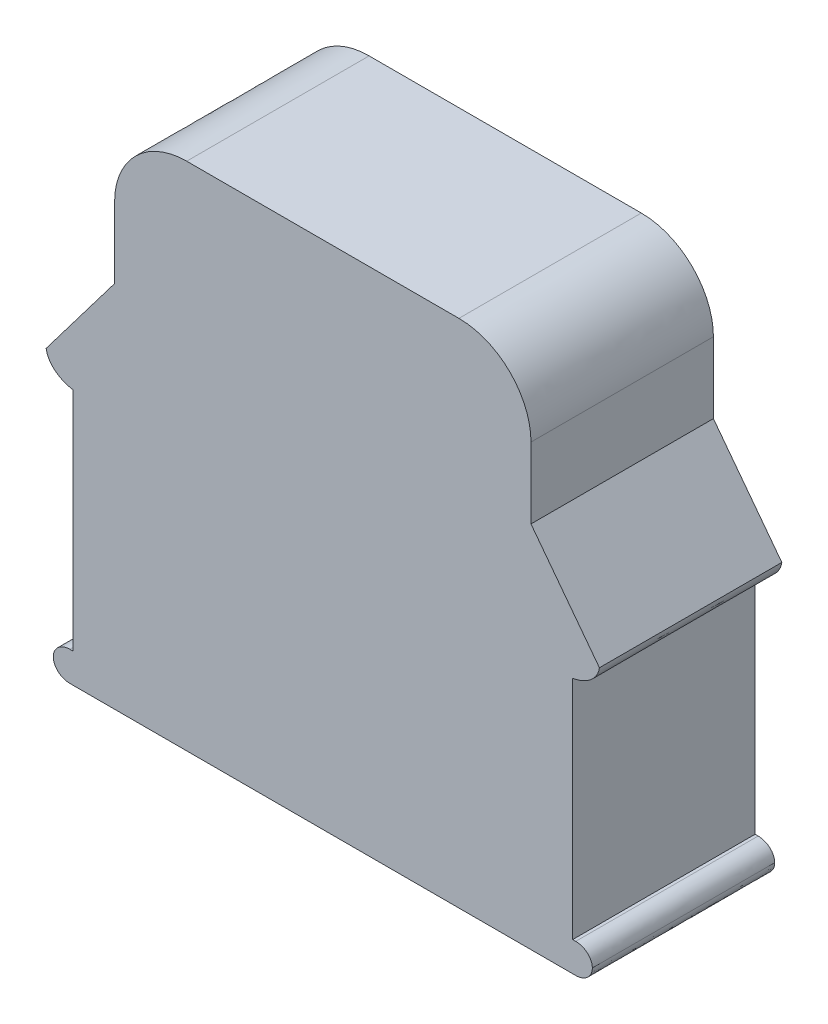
ISO-10303-21;
HEADER;
FILE_DESCRIPTION(('STEP AP214'),'2;1');
FILE_NAME('part.step','',(''),(''),'','','');
FILE_SCHEMA(('AUTOMOTIVE_DESIGN { 1 0 10303 214 1 1 1 1 }'));
ENDSEC;
DATA;
#1=APPLICATION_CONTEXT('core data for automotive mechanical design processes');
#2=APPLICATION_PROTOCOL_DEFINITION('international standard','automotive_design',2000,#1);
#3=PRODUCT_CONTEXT('',#1,'mechanical');
#4=PRODUCT('Part','Part','',(#3));
#5=PRODUCT_RELATED_PRODUCT_CATEGORY('part','',(#4));
#6=PRODUCT_DEFINITION_FORMATION('','',#4);
#7=PRODUCT_DEFINITION_CONTEXT('part definition',#1,'design');
#8=PRODUCT_DEFINITION('design','',#6,#7);
#9=PRODUCT_DEFINITION_SHAPE('','',#8);
#10=(LENGTH_UNIT() NAMED_UNIT(*) SI_UNIT(.MILLI.,.METRE.));
#11=(NAMED_UNIT(*) PLANE_ANGLE_UNIT() SI_UNIT($,.RADIAN.));
#12=(NAMED_UNIT(*) SI_UNIT($,.STERADIAN.) SOLID_ANGLE_UNIT());
#13=UNCERTAINTY_MEASURE_WITH_UNIT(LENGTH_MEASURE(1.E-05),#10,'distance_accuracy_value','');
#14=(GEOMETRIC_REPRESENTATION_CONTEXT(3) GLOBAL_UNCERTAINTY_ASSIGNED_CONTEXT((#13)) GLOBAL_UNIT_ASSIGNED_CONTEXT((#10,
#11,#12)) REPRESENTATION_CONTEXT('',''));
#15=CARTESIAN_POINT('',(0.,0.,0.));
#16=DIRECTION('',(0.,0.,1.));
#17=DIRECTION('',(1.,0.,0.));
#18=AXIS2_PLACEMENT_3D('',#15,#16,#17);
#19=CARTESIAN_POINT('',(194.745098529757,0.,25.));
#20=DIRECTION('',(1.,0.,0.));
#21=DIRECTION('',(0.,0.,-1.));
#22=AXIS2_PLACEMENT_3D('',#19,#20,#21);
#23=PLANE('',#22);
#24=DIRECTION('',(0.,-1.,0.));
#25=VECTOR('',#24,1.);
#26=CARTESIAN_POINT('',(194.745098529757,0.,0.));
#27=LINE('',#26,#25);
#28=CARTESIAN_POINT('',(194.745098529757,-143.260402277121,0.));
#29=VERTEX_POINT('',#28);
#30=CARTESIAN_POINT('',(194.745098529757,-174.278802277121,0.));
#31=VERTEX_POINT('',#30);
#32=EDGE_CURVE('E294',#29,#31,#27,.T.);
#33=ORIENTED_EDGE('',*,*,#32,.F.);
#34=DIRECTION('',(0.,0.,-1.));
#35=VECTOR('',#34,1.);
#36=CARTESIAN_POINT('',(194.745098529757,-143.260402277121,25.));
#37=LINE('',#36,#35);
#38=CARTESIAN_POINT('',(194.745098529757,-143.260402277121,25.));
#39=VERTEX_POINT('',#38);
#40=EDGE_CURVE('E11',#39,#29,#37,.T.);
#41=ORIENTED_EDGE('',*,*,#40,.F.);
#42=DIRECTION('',(0.,-1.,0.));
#43=VECTOR('',#42,1.);
#44=CARTESIAN_POINT('',(194.745098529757,0.,25.));
#45=LINE('',#44,#43);
#46=CARTESIAN_POINT('',(194.745098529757,-174.278802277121,25.));
#47=VERTEX_POINT('',#46);
#48=EDGE_CURVE('E392',#39,#47,#45,.T.);
#49=ORIENTED_EDGE('',*,*,#48,.T.);
#50=DIRECTION('',(0.,0.,-1.));
#51=VECTOR('',#50,1.);
#52=CARTESIAN_POINT('',(194.745098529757,-174.278802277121,25.));
#53=LINE('',#52,#51);
#54=EDGE_CURVE('E52',#47,#31,#53,.T.);
#55=ORIENTED_EDGE('',*,*,#54,.T.);
#56=EDGE_LOOP('',(#33,#41,#49,#55));
#57=FACE_BOUND('',#56,.T.);
#58=ADVANCED_FACE('F36',(#57),#23,.T.);
#59=CARTESIAN_POINT('',(197.055798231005,-142.323702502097,25.));
#60=CARTESIAN_POINT('',(196.433398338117,-142.792402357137,25.));
#61=CARTESIAN_POINT('',(195.634898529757,-143.125802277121,25.));
#62=CARTESIAN_POINT('',(194.745098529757,-143.260402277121,25.));
#63=B_SPLINE_CURVE_WITH_KNOTS('',3,(#59,#60,#61,#62),.UNSPECIFIED.,.F.,.F.,(4,4),(0.87500001,
0.916666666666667),.UNSPECIFIED.);
#64=DIRECTION('',(0.,0.,-1.));
#65=VECTOR('',#64,1.);
#66=SURFACE_OF_LINEAR_EXTRUSION('',#63,#65);
#67=CARTESIAN_POINT('',(197.055798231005,-142.323702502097,0.));
#68=CARTESIAN_POINT('',(196.433398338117,-142.792402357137,0.));
#69=CARTESIAN_POINT('',(195.634898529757,-143.125802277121,0.));
#70=CARTESIAN_POINT('',(194.745098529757,-143.260402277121,0.));
#71=B_SPLINE_CURVE_WITH_KNOTS('',3,(#67,#68,#69,#70),.UNSPECIFIED.,.F.,.F.,(4,4),(0.87500001,
0.916666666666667),.UNSPECIFIED.);
#72=CARTESIAN_POINT('',(197.055798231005,-142.323702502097,0.));
#73=VERTEX_POINT('',#72);
#74=EDGE_CURVE('E291',#73,#29,#71,.T.);
#75=ORIENTED_EDGE('',*,*,#74,.F.);
#76=DIRECTION('',(0.,0.,-1.));
#77=VECTOR('',#76,1.);
#78=CARTESIAN_POINT('',(197.055798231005,-142.323702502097,25.));
#79=LINE('',#78,#77);
#80=CARTESIAN_POINT('',(197.055798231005,-142.323702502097,25.));
#81=VERTEX_POINT('',#80);
#82=EDGE_CURVE('E44',#81,#73,#79,.T.);
#83=ORIENTED_EDGE('',*,*,#82,.F.);
#84=EDGE_CURVE('E393',#81,#39,#63,.T.);
#85=ORIENTED_EDGE('',*,*,#84,.T.);
#86=ORIENTED_EDGE('',*,*,#40,.T.);
#87=EDGE_LOOP('',(#75,#83,#85,#86));
#88=FACE_BOUND('',#87,.T.);
#89=ADVANCED_FACE('F292',(#88),#66,.T.);
#90=CARTESIAN_POINT('',(198.408798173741,-140.182102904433,25.));
#91=CARTESIAN_POINT('',(198.289498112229,-141.020302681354,25.));
#92=CARTESIAN_POINT('',(197.794598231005,-141.767202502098,25.));
#93=CARTESIAN_POINT('',(197.055798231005,-142.323702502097,25.));
#94=B_SPLINE_CURVE_WITH_KNOTS('',3,(#90,#91,#92,#93),.UNSPECIFIED.,.F.,.F.,(4,4),
(0.833333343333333,0.875),.UNSPECIFIED.);
#95=DIRECTION('',(0.,0.,-1.));
#96=VECTOR('',#95,1.);
#97=SURFACE_OF_LINEAR_EXTRUSION('',#94,#96);
#98=CARTESIAN_POINT('',(198.408798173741,-140.182102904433,0.));
#99=CARTESIAN_POINT('',(198.289498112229,-141.020302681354,0.));
#100=CARTESIAN_POINT('',(197.794598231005,-141.767202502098,0.));
#101=CARTESIAN_POINT('',(197.055798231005,-142.323702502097,0.));
#102=B_SPLINE_CURVE_WITH_KNOTS('',3,(#98,#99,#100,#101),.UNSPECIFIED.,.F.,.F.,(4,4),
(0.833333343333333,0.875),.UNSPECIFIED.);
#103=CARTESIAN_POINT('',(198.408798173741,-140.182102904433,0.));
#104=VERTEX_POINT('',#103);
#105=EDGE_CURVE('E283',#104,#73,#102,.T.);
#106=ORIENTED_EDGE('',*,*,#105,.F.);
#107=DIRECTION('',(0.,0.,-1.));
#108=VECTOR('',#107,1.);
#109=CARTESIAN_POINT('',(198.408798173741,-140.182102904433,25.));
#110=LINE('',#109,#108);
#111=CARTESIAN_POINT('',(198.408798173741,-140.182102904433,25.));
#112=VERTEX_POINT('',#111);
#113=EDGE_CURVE('E276',#112,#104,#110,.T.);
#114=ORIENTED_EDGE('',*,*,#113,.F.);
#115=EDGE_CURVE('E286',#112,#81,#94,.T.);
#116=ORIENTED_EDGE('',*,*,#115,.T.);
#117=ORIENTED_EDGE('',*,*,#82,.T.);
#118=EDGE_LOOP('',(#106,#114,#116,#117));
#119=FACE_BOUND('',#118,.T.);
#120=ADVANCED_FACE('F281',(#119),#97,.T.);
#121=CARTESIAN_POINT('',(58.5471853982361,44.3696809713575,25.));
#122=DIRECTION('',(0.796988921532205,0.603993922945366,0.));
#123=DIRECTION('',(-0.603993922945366,0.796988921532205,0.));
#124=AXIS2_PLACEMENT_3D('',#121,#122,#123);
#125=PLANE('',#124);
#126=DIRECTION('',(0.603993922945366,-0.796988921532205,0.));
#127=VECTOR('',#126,1.);
#128=CARTESIAN_POINT('',(58.5471853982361,44.3696809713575,0.));
#129=LINE('',#128,#127);
#130=CARTESIAN_POINT('',(189.028498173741,-127.804502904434,0.));
#131=VERTEX_POINT('',#130);
#132=EDGE_CURVE('E299',#131,#104,#129,.T.);
#133=ORIENTED_EDGE('',*,*,#132,.F.);
#134=DIRECTION('',(0.,0.,-1.));
#135=VECTOR('',#134,1.);
#136=CARTESIAN_POINT('',(189.028498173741,-127.804502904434,25.));
#137=LINE('',#136,#135);
#138=CARTESIAN_POINT('',(189.028498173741,-127.804502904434,25.));
#139=VERTEX_POINT('',#138);
#140=EDGE_CURVE('E274',#139,#131,#137,.T.);
#141=ORIENTED_EDGE('',*,*,#140,.F.);
#142=DIRECTION('',(0.603993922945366,-0.796988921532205,0.));
#143=VECTOR('',#142,1.);
#144=CARTESIAN_POINT('',(58.5471853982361,44.3696809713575,25.));
#145=LINE('',#144,#143);
#146=EDGE_CURVE('E528',#139,#112,#145,.T.);
#147=ORIENTED_EDGE('',*,*,#146,.T.);
#148=ORIENTED_EDGE('',*,*,#113,.T.);
#149=EDGE_LOOP('',(#133,#141,#147,#148));
#150=FACE_BOUND('',#149,.T.);
#151=ADVANCED_FACE('F411',(#150),#125,.T.);
#152=CARTESIAN_POINT('',(189.028498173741,0.,25.));
#153=DIRECTION('',(1.,0.,0.));
#154=DIRECTION('',(0.,0.,-1.));
#155=AXIS2_PLACEMENT_3D('',#152,#153,#154);
#156=PLANE('',#155);
#157=DIRECTION('',(0.,-1.,0.));
#158=VECTOR('',#157,1.);
#159=CARTESIAN_POINT('',(189.028498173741,0.,0.));
#160=LINE('',#159,#158);
#161=CARTESIAN_POINT('',(189.028498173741,-118.086202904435,0.));
#162=VERTEX_POINT('',#161);
#163=EDGE_CURVE('E301',#162,#131,#160,.T.);
#164=ORIENTED_EDGE('',*,*,#163,.F.);
#165=DIRECTION('',(0.,0.,-1.));
#166=VECTOR('',#165,1.);
#167=CARTESIAN_POINT('',(189.028498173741,-118.086202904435,25.));
#168=LINE('',#167,#166);
#169=CARTESIAN_POINT('',(189.028498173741,-118.086202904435,25.));
#170=VERTEX_POINT('',#169);
#171=EDGE_CURVE('E272',#170,#162,#168,.T.);
#172=ORIENTED_EDGE('',*,*,#171,.F.);
#173=DIRECTION('',(0.,-1.,0.));
#174=VECTOR('',#173,1.);
#175=CARTESIAN_POINT('',(189.028498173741,0.,25.));
#176=LINE('',#175,#174);
#177=EDGE_CURVE('E434',#170,#139,#176,.T.);
#178=ORIENTED_EDGE('',*,*,#177,.T.);
#179=ORIENTED_EDGE('',*,*,#140,.T.);
#180=EDGE_LOOP('',(#164,#172,#178,#179));
#181=FACE_BOUND('',#180,.T.);
#182=ADVANCED_FACE('F414',(#181),#156,.T.);
#183=CARTESIAN_POINT('',(179.149900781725,-108.341002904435,25.));
#184=CARTESIAN_POINT('',(184.583199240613,-108.341003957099,25.));
#185=CARTESIAN_POINT('',(189.028498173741,-112.727102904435,25.));
#186=CARTESIAN_POINT('',(189.028498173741,-118.086202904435,25.));
#187=B_SPLINE_CURVE_WITH_KNOTS('',3,(#183,#184,#185,#186),.UNSPECIFIED.,.F.,.F.,(4,4),
(0.708333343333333,0.75),.UNSPECIFIED.);
#188=DIRECTION('',(0.,0.,-1.));
#189=VECTOR('',#188,1.);
#190=SURFACE_OF_LINEAR_EXTRUSION('',#187,#189);
#191=CARTESIAN_POINT('',(179.149900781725,-108.341002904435,0.));
#192=CARTESIAN_POINT('',(184.583199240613,-108.341003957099,0.));
#193=CARTESIAN_POINT('',(189.028498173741,-112.727102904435,0.));
#194=CARTESIAN_POINT('',(189.028498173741,-118.086202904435,0.));
#195=B_SPLINE_CURVE_WITH_KNOTS('',3,(#191,#192,#193,#194),.UNSPECIFIED.,.F.,.F.,(4,4),
(0.708333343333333,0.75),.UNSPECIFIED.);
#196=CARTESIAN_POINT('',(179.149900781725,-108.341002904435,0.));
#197=VERTEX_POINT('',#196);
#198=EDGE_CURVE('E312',#197,#162,#195,.T.);
#199=ORIENTED_EDGE('',*,*,#198,.F.);
#200=DIRECTION('',(0.,0.,-1.));
#201=VECTOR('',#200,1.);
#202=CARTESIAN_POINT('',(179.149900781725,-108.341002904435,25.));
#203=LINE('',#202,#201);
#204=CARTESIAN_POINT('',(179.149900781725,-108.341002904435,25.));
#205=VERTEX_POINT('',#204);
#206=EDGE_CURVE('E270',#205,#197,#203,.T.);
#207=ORIENTED_EDGE('',*,*,#206,.F.);
#208=EDGE_CURVE('E426',#205,#170,#187,.T.);
#209=ORIENTED_EDGE('',*,*,#208,.T.);
#210=ORIENTED_EDGE('',*,*,#171,.T.);
#211=EDGE_LOOP('',(#199,#207,#209,#210));
#212=FACE_BOUND('',#211,.T.);
#213=ADVANCED_FACE('F418',(#212),#190,.T.);
#214=CARTESIAN_POINT('',(0.,-108.341002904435,25.));
#215=DIRECTION('',(0.,1.,0.));
#216=DIRECTION('',(0.,0.,1.));
#217=AXIS2_PLACEMENT_3D('',#214,#215,#216);
#218=PLANE('',#217);
#219=DIRECTION('',(1.,0.,0.));
#220=VECTOR('',#219,1.);
#221=CARTESIAN_POINT('',(0.,-108.341002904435,0.));
#222=LINE('',#221,#220);
#223=CARTESIAN_POINT('',(141.842600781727,-108.341002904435,0.));
#224=VERTEX_POINT('',#223);
#225=EDGE_CURVE('E317',#224,#197,#222,.T.);
#226=ORIENTED_EDGE('',*,*,#225,.F.);
#227=DIRECTION('',(0.,0.,-1.));
#228=VECTOR('',#227,1.);
#229=CARTESIAN_POINT('',(141.842600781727,-108.341002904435,25.));
#230=LINE('',#229,#228);
#231=CARTESIAN_POINT('',(141.842600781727,-108.341002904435,25.));
#232=VERTEX_POINT('',#231);
#233=EDGE_CURVE('E268',#232,#224,#230,.T.);
#234=ORIENTED_EDGE('',*,*,#233,.F.);
#235=DIRECTION('',(1.,0.,0.));
#236=VECTOR('',#235,1.);
#237=CARTESIAN_POINT('',(0.,-108.341002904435,25.));
#238=LINE('',#237,#236);
#239=EDGE_CURVE('E433',#232,#205,#238,.T.);
#240=ORIENTED_EDGE('',*,*,#239,.T.);
#241=ORIENTED_EDGE('',*,*,#206,.T.);
#242=EDGE_LOOP('',(#226,#234,#240,#241));
#243=FACE_BOUND('',#242,.T.);
#244=ADVANCED_FACE('F423',(#243),#218,.T.);
#245=CARTESIAN_POINT('',(131.963900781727,-118.086200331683,25.));
#246=CARTESIAN_POINT('',(131.963901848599,-112.726301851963,25.));
#247=CARTESIAN_POINT('',(136.409200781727,-108.341002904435,25.));
#248=CARTESIAN_POINT('',(141.842600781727,-108.341002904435,25.));
#249=B_SPLINE_CURVE_WITH_KNOTS('',3,(#245,#246,#247,#248),.UNSPECIFIED.,.F.,.F.,(4,4),
(0.62500001,0.666666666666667),.UNSPECIFIED.);
#250=DIRECTION('',(0.,0.,-1.));
#251=VECTOR('',#250,1.);
#252=SURFACE_OF_LINEAR_EXTRUSION('',#249,#251);
#253=CARTESIAN_POINT('',(131.963900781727,-118.086200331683,0.));
#254=CARTESIAN_POINT('',(131.963901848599,-112.726301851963,0.));
#255=CARTESIAN_POINT('',(136.409200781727,-108.341002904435,0.));
#256=CARTESIAN_POINT('',(141.842600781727,-108.341002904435,0.));
#257=B_SPLINE_CURVE_WITH_KNOTS('',3,(#253,#254,#255,#256),.UNSPECIFIED.,.F.,.F.,(4,4),
(0.62500001,0.666666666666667),.UNSPECIFIED.);
#258=CARTESIAN_POINT('',(131.963900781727,-118.086200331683,0.));
#259=VERTEX_POINT('',#258);
#260=EDGE_CURVE('E323',#259,#224,#257,.T.);
#261=ORIENTED_EDGE('',*,*,#260,.F.);
#262=DIRECTION('',(0.,0.,-1.));
#263=VECTOR('',#262,1.);
#264=CARTESIAN_POINT('',(131.963900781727,-118.086200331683,25.));
#265=LINE('',#264,#263);
#266=CARTESIAN_POINT('',(131.963900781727,-118.086200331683,25.));
#267=VERTEX_POINT('',#266);
#268=EDGE_CURVE('E266',#267,#259,#265,.T.);
#269=ORIENTED_EDGE('',*,*,#268,.F.);
#270=EDGE_CURVE('E440',#267,#232,#249,.T.);
#271=ORIENTED_EDGE('',*,*,#270,.T.);
#272=ORIENTED_EDGE('',*,*,#233,.T.);
#273=EDGE_LOOP('',(#261,#269,#271,#272));
#274=FACE_BOUND('',#273,.T.);
#275=ADVANCED_FACE('F451',(#274),#252,.T.);
#276=CARTESIAN_POINT('',(131.963900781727,0.,25.));
#277=DIRECTION('',(-1.,0.,0.));
#278=DIRECTION('',(0.,0.,1.));
#279=AXIS2_PLACEMENT_3D('',#276,#277,#278);
#280=PLANE('',#279);
#281=DIRECTION('',(0.,1.,0.));
#282=VECTOR('',#281,1.);
#283=CARTESIAN_POINT('',(131.963900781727,0.,0.));
#284=LINE('',#283,#282);
#285=CARTESIAN_POINT('',(131.963900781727,-127.804400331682,0.));
#286=VERTEX_POINT('',#285);
#287=EDGE_CURVE('E328',#286,#259,#284,.T.);
#288=ORIENTED_EDGE('',*,*,#287,.F.);
#289=DIRECTION('',(0.,0.,-1.));
#290=VECTOR('',#289,1.);
#291=CARTESIAN_POINT('',(131.963900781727,-127.804400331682,25.));
#292=LINE('',#291,#290);
#293=CARTESIAN_POINT('',(131.963900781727,-127.804400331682,25.));
#294=VERTEX_POINT('',#293);
#295=EDGE_CURVE('E264',#294,#286,#292,.T.);
#296=ORIENTED_EDGE('',*,*,#295,.F.);
#297=DIRECTION('',(0.,1.,0.));
#298=VECTOR('',#297,1.);
#299=CARTESIAN_POINT('',(131.963900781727,0.,25.));
#300=LINE('',#299,#298);
#301=EDGE_CURVE('E446',#294,#267,#300,.T.);
#302=ORIENTED_EDGE('',*,*,#301,.T.);
#303=ORIENTED_EDGE('',*,*,#268,.T.);
#304=EDGE_LOOP('',(#288,#296,#302,#303));
#305=FACE_BOUND('',#304,.T.);
#306=ADVANCED_FACE('F454',(#305),#280,.T.);
#307=CARTESIAN_POINT('',(145.345191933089,-110.147036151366,25.));
#308=DIRECTION('',(-0.7969943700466,0.603986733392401,0.));
#309=DIRECTION('',(-0.603986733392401,-0.7969943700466,0.));
#310=AXIS2_PLACEMENT_3D('',#307,#308,#309);
#311=PLANE('',#310);
#312=DIRECTION('',(0.603986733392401,0.7969943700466,0.));
#313=VECTOR('',#312,1.);
#314=CARTESIAN_POINT('',(145.345191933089,-110.147036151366,0.));
#315=LINE('',#314,#313);
#316=CARTESIAN_POINT('',(122.583700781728,-140.182100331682,0.));
#317=VERTEX_POINT('',#316);
#318=EDGE_CURVE('E334',#317,#286,#315,.T.);
#319=ORIENTED_EDGE('',*,*,#318,.F.);
#320=DIRECTION('',(0.,0.,-1.));
#321=VECTOR('',#320,1.);
#322=CARTESIAN_POINT('',(122.583700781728,-140.182100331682,25.));
#323=LINE('',#322,#321);
#324=CARTESIAN_POINT('',(122.583700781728,-140.182100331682,25.));
#325=VERTEX_POINT('',#324);
#326=EDGE_CURVE('E262',#325,#317,#323,.T.);
#327=ORIENTED_EDGE('',*,*,#326,.F.);
#328=DIRECTION('',(0.603986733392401,0.7969943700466,0.));
#329=VECTOR('',#328,1.);
#330=CARTESIAN_POINT('',(145.345191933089,-110.147036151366,25.));
#331=LINE('',#330,#329);
#332=EDGE_CURVE('E477',#325,#294,#331,.T.);
#333=ORIENTED_EDGE('',*,*,#332,.T.);
#334=ORIENTED_EDGE('',*,*,#295,.T.);
#335=EDGE_LOOP('',(#319,#327,#333,#334));
#336=FACE_BOUND('',#335,.T.);
#337=ADVANCED_FACE('F458',(#336),#311,.T.);
#338=CARTESIAN_POINT('',(123.936600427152,-142.323700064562,25.));
#339=CARTESIAN_POINT('',(123.197900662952,-141.767200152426,25.));
#340=CARTESIAN_POINT('',(122.703000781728,-141.020300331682,25.));
#341=CARTESIAN_POINT('',(122.583700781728,-140.182100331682,25.));
#342=B_SPLINE_CURVE_WITH_KNOTS('',3,(#338,#339,#340,#341),.UNSPECIFIED.,.F.,.F.,(4,4),
(0.50000001,0.541666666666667),.UNSPECIFIED.);
#343=DIRECTION('',(0.,0.,-1.));
#344=VECTOR('',#343,1.);
#345=SURFACE_OF_LINEAR_EXTRUSION('',#342,#344);
#346=CARTESIAN_POINT('',(123.936600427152,-142.323700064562,0.));
#347=CARTESIAN_POINT('',(123.197900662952,-141.767200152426,0.));
#348=CARTESIAN_POINT('',(122.703000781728,-141.020300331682,0.));
#349=CARTESIAN_POINT('',(122.583700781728,-140.182100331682,0.));
#350=B_SPLINE_CURVE_WITH_KNOTS('',3,(#346,#347,#348,#349),.UNSPECIFIED.,.F.,.F.,(4,4),
(0.50000001,0.541666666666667),.UNSPECIFIED.);
#351=CARTESIAN_POINT('',(123.936600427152,-142.323700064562,0.));
#352=VERTEX_POINT('',#351);
#353=EDGE_CURVE('E337',#352,#317,#350,.T.);
#354=ORIENTED_EDGE('',*,*,#353,.F.);
#355=DIRECTION('',(0.,0.,-1.));
#356=VECTOR('',#355,1.);
#357=CARTESIAN_POINT('',(123.936600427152,-142.323700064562,25.));
#358=LINE('',#357,#356);
#359=CARTESIAN_POINT('',(123.936600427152,-142.323700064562,25.));
#360=VERTEX_POINT('',#359);
#361=EDGE_CURVE('E260',#360,#352,#358,.T.);
#362=ORIENTED_EDGE('',*,*,#361,.F.);
#363=EDGE_CURVE('E471',#360,#325,#342,.T.);
#364=ORIENTED_EDGE('',*,*,#363,.T.);
#365=ORIENTED_EDGE('',*,*,#326,.T.);
#366=EDGE_LOOP('',(#354,#362,#364,#365));
#367=FACE_BOUND('',#366,.T.);
#368=ADVANCED_FACE('F462',(#367),#345,.T.);
#369=CARTESIAN_POINT('',(126.2475,-143.260500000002,25.));
#370=CARTESIAN_POINT('',(125.357600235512,-143.125999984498,25.));
#371=CARTESIAN_POINT('',(124.559100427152,-142.792400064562,25.));
#372=CARTESIAN_POINT('',(123.936600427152,-142.323700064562,25.));
#373=B_SPLINE_CURVE_WITH_KNOTS('',3,(#369,#370,#371,#372),.UNSPECIFIED.,.F.,.F.,(4,4),
(0.458333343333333,0.5),.UNSPECIFIED.);
#374=DIRECTION('',(0.,0.,-1.));
#375=VECTOR('',#374,1.);
#376=SURFACE_OF_LINEAR_EXTRUSION('',#373,#375);
#377=CARTESIAN_POINT('',(126.2475,-143.260500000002,0.));
#378=CARTESIAN_POINT('',(125.357600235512,-143.125999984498,0.));
#379=CARTESIAN_POINT('',(124.559100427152,-142.792400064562,0.));
#380=CARTESIAN_POINT('',(123.936600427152,-142.323700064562,0.));
#381=B_SPLINE_CURVE_WITH_KNOTS('',3,(#377,#378,#379,#380),.UNSPECIFIED.,.F.,.F.,(4,4),
(0.458333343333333,0.5),.UNSPECIFIED.);
#382=CARTESIAN_POINT('',(126.2475,-143.2605,0.));
#383=VERTEX_POINT('',#382);
#384=EDGE_CURVE('E342',#383,#352,#381,.T.);
#385=ORIENTED_EDGE('',*,*,#384,.F.);
#386=DIRECTION('',(0.,0.,-1.));
#387=VECTOR('',#386,1.);
#388=CARTESIAN_POINT('',(126.2475,-143.2605,25.));
#389=LINE('',#388,#387);
#390=CARTESIAN_POINT('',(126.2475,-143.2605,25.));
#391=VERTEX_POINT('',#390);
#392=EDGE_CURVE('E258',#391,#383,#389,.T.);
#393=ORIENTED_EDGE('',*,*,#392,.F.);
#394=EDGE_CURVE('E476',#391,#360,#373,.T.);
#395=ORIENTED_EDGE('',*,*,#394,.T.);
#396=ORIENTED_EDGE('',*,*,#361,.T.);
#397=EDGE_LOOP('',(#385,#393,#395,#396));
#398=FACE_BOUND('',#397,.T.);
#399=ADVANCED_FACE('F467',(#398),#376,.T.);
#400=CARTESIAN_POINT('',(126.2475,0.,25.));
#401=DIRECTION('',(-1.,0.,0.));
#402=DIRECTION('',(0.,0.,1.));
#403=AXIS2_PLACEMENT_3D('',#400,#401,#402);
#404=PLANE('',#403);
#405=DIRECTION('',(0.,1.,0.));
#406=VECTOR('',#405,1.);
#407=CARTESIAN_POINT('',(126.2475,0.,0.));
#408=LINE('',#407,#406);
#409=CARTESIAN_POINT('',(126.2475,-174.278799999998,0.));
#410=VERTEX_POINT('',#409);
#411=EDGE_CURVE('E350',#410,#383,#408,.T.);
#412=ORIENTED_EDGE('',*,*,#411,.F.);
#413=DIRECTION('',(0.,0.,-1.));
#414=VECTOR('',#413,1.);
#415=CARTESIAN_POINT('',(126.2475,-174.278799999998,25.));
#416=LINE('',#415,#414);
#417=CARTESIAN_POINT('',(126.2475,-174.278799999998,25.));
#418=VERTEX_POINT('',#417);
#419=EDGE_CURVE('E256',#418,#410,#416,.T.);
#420=ORIENTED_EDGE('',*,*,#419,.F.);
#421=DIRECTION('',(0.,1.,0.));
#422=VECTOR('',#421,1.);
#423=CARTESIAN_POINT('',(126.2475,0.,25.));
#424=LINE('',#423,#422);
#425=EDGE_CURVE('E486',#418,#391,#424,.T.);
#426=ORIENTED_EDGE('',*,*,#425,.T.);
#427=ORIENTED_EDGE('',*,*,#392,.T.);
#428=EDGE_LOOP('',(#412,#420,#426,#427));
#429=FACE_BOUND('',#428,.T.);
#430=ADVANCED_FACE('F504',(#429),#404,.T.);
#431=CARTESIAN_POINT('',(7.40979747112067E-10,-174.278800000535,25.));
#432=DIRECTION('',(-4.25169181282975E-12,1.,0.));
#433=DIRECTION('',(-1.,-4.25169181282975E-12,0.));
#434=AXIS2_PLACEMENT_3D('',#431,#432,#433);
#435=PLANE('',#434);
#436=DIRECTION('',(1.,4.25169181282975E-12,0.));
#437=VECTOR('',#436,1.);
#438=CARTESIAN_POINT('',(7.40979747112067E-10,-174.278800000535,0.));
#439=LINE('',#438,#437);
#440=CARTESIAN_POINT('',(125.8297,-174.2788,0.));
#441=VERTEX_POINT('',#440);
#442=EDGE_CURVE('E356',#441,#410,#439,.T.);
#443=ORIENTED_EDGE('',*,*,#442,.F.);
#444=DIRECTION('',(0.,0.,-1.));
#445=VECTOR('',#444,1.);
#446=CARTESIAN_POINT('',(125.8297,-174.2788,25.));
#447=LINE('',#446,#445);
#448=CARTESIAN_POINT('',(125.8297,-174.2788,25.));
#449=VERTEX_POINT('',#448);
#450=EDGE_CURVE('E254',#449,#441,#447,.T.);
#451=ORIENTED_EDGE('',*,*,#450,.F.);
#452=DIRECTION('',(1.,4.25169181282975E-12,0.));
#453=VECTOR('',#452,1.);
#454=CARTESIAN_POINT('',(7.40979747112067E-10,-174.278800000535,25.));
#455=LINE('',#454,#453);
#456=EDGE_CURVE('E491',#449,#418,#455,.T.);
#457=ORIENTED_EDGE('',*,*,#456,.T.);
#458=ORIENTED_EDGE('',*,*,#419,.T.);
#459=EDGE_LOOP('',(#443,#451,#457,#458));
#460=FACE_BOUND('',#459,.T.);
#461=ADVANCED_FACE('F502',(#460),#435,.T.);
#462=CARTESIAN_POINT('',(123.5564,-176.306199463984,25.));
#463=CARTESIAN_POINT('',(123.556400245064,-175.189499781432,25.));
#464=CARTESIAN_POINT('',(124.5775,-174.2788,25.));
#465=CARTESIAN_POINT('',(125.8297,-174.2788,25.));
#466=B_SPLINE_CURVE_WITH_KNOTS('',3,(#462,#463,#464,#465),.UNSPECIFIED.,.F.,.F.,(4,4),
(0.333333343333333,0.375),.UNSPECIFIED.);
#467=DIRECTION('',(0.,0.,-1.));
#468=VECTOR('',#467,1.);
#469=SURFACE_OF_LINEAR_EXTRUSION('',#466,#468);
#470=CARTESIAN_POINT('',(123.5564,-176.306199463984,0.));
#471=CARTESIAN_POINT('',(123.556400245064,-175.189499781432,0.));
#472=CARTESIAN_POINT('',(124.5775,-174.2788,0.));
#473=CARTESIAN_POINT('',(125.8297,-174.2788,0.));
#474=B_SPLINE_CURVE_WITH_KNOTS('',3,(#470,#471,#472,#473),.UNSPECIFIED.,.F.,.F.,(4,4),
(0.333333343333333,0.375),.UNSPECIFIED.);
#475=CARTESIAN_POINT('',(123.5564,-176.306199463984,0.));
#476=VERTEX_POINT('',#475);
#477=EDGE_CURVE('E359',#476,#441,#474,.T.);
#478=ORIENTED_EDGE('',*,*,#477,.F.);
#479=DIRECTION('',(0.,0.,-1.));
#480=VECTOR('',#479,1.);
#481=CARTESIAN_POINT('',(123.5564,-176.306199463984,25.));
#482=LINE('',#481,#480);
#483=CARTESIAN_POINT('',(123.5564,-176.306199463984,25.));
#484=VERTEX_POINT('',#483);
#485=EDGE_CURVE('E249',#484,#476,#482,.T.);
#486=ORIENTED_EDGE('',*,*,#485,.F.);
#487=EDGE_CURVE('E235',#484,#449,#466,.T.);
#488=ORIENTED_EDGE('',*,*,#487,.T.);
#489=ORIENTED_EDGE('',*,*,#450,.T.);
#490=EDGE_LOOP('',(#478,#486,#488,#489));
#491=FACE_BOUND('',#490,.T.);
#492=ADVANCED_FACE('F226',(#491),#469,.T.);
#493=CARTESIAN_POINT('',(125.829699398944,-178.333399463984,25.));
#494=CARTESIAN_POINT('',(124.577499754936,-178.33339924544,25.));
#495=CARTESIAN_POINT('',(123.5564,-177.422799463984,25.));
#496=CARTESIAN_POINT('',(123.5564,-176.306199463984,25.));
#497=B_SPLINE_CURVE_WITH_KNOTS('',3,(#493,#494,#495,#496),.UNSPECIFIED.,.F.,.F.,(4,4),
(0.25000001,0.291666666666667),.UNSPECIFIED.);
#498=DIRECTION('',(0.,0.,-1.));
#499=VECTOR('',#498,1.);
#500=SURFACE_OF_LINEAR_EXTRUSION('',#497,#499);
#501=CARTESIAN_POINT('',(125.829699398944,-178.333399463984,0.));
#502=CARTESIAN_POINT('',(124.577499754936,-178.33339924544,0.));
#503=CARTESIAN_POINT('',(123.5564,-177.422799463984,0.));
#504=CARTESIAN_POINT('',(123.5564,-176.306199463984,0.));
#505=B_SPLINE_CURVE_WITH_KNOTS('',3,(#501,#502,#503,#504),.UNSPECIFIED.,.F.,.F.,(4,4),
(0.25000001,0.291666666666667),.UNSPECIFIED.);
#506=CARTESIAN_POINT('',(125.829699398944,-178.333399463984,0.));
#507=VERTEX_POINT('',#506);
#508=EDGE_CURVE('E364',#507,#476,#505,.T.);
#509=ORIENTED_EDGE('',*,*,#508,.F.);
#510=DIRECTION('',(0.,0.,-1.));
#511=VECTOR('',#510,1.);
#512=CARTESIAN_POINT('',(125.829699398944,-178.333399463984,25.));
#513=LINE('',#512,#511);
#514=CARTESIAN_POINT('',(125.829699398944,-178.333399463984,25.));
#515=VERTEX_POINT('',#514);
#516=EDGE_CURVE('E244',#515,#507,#513,.T.);
#517=ORIENTED_EDGE('',*,*,#516,.F.);
#518=EDGE_CURVE('E230',#515,#484,#497,.T.);
#519=ORIENTED_EDGE('',*,*,#518,.T.);
#520=ORIENTED_EDGE('',*,*,#485,.T.);
#521=EDGE_LOOP('',(#509,#517,#519,#520));
#522=FACE_BOUND('',#521,.T.);
#523=ADVANCED_FACE('F221',(#522),#500,.T.);
#524=CARTESIAN_POINT('',(0.,-178.333399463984,25.));
#525=DIRECTION('',(0.,-1.,0.));
#526=DIRECTION('',(0.,0.,-1.));
#527=AXIS2_PLACEMENT_3D('',#524,#525,#526);
#528=PLANE('',#527);
#529=DIRECTION('',(-1.,0.,0.));
#530=VECTOR('',#529,1.);
#531=CARTESIAN_POINT('',(0.,-178.333399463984,0.));
#532=LINE('',#531,#530);
#533=CARTESIAN_POINT('',(195.16309939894,-178.333399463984,0.));
#534=VERTEX_POINT('',#533);
#535=EDGE_CURVE('E247',#534,#507,#532,.T.);
#536=ORIENTED_EDGE('',*,*,#535,.F.);
#537=DIRECTION('',(0.,0.,-1.));
#538=VECTOR('',#537,1.);
#539=CARTESIAN_POINT('',(195.16309939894,-178.333399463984,25.));
#540=LINE('',#539,#538);
#541=CARTESIAN_POINT('',(195.16309939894,-178.333399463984,25.));
#542=VERTEX_POINT('',#541);
#543=EDGE_CURVE('E183',#542,#534,#540,.T.);
#544=ORIENTED_EDGE('',*,*,#543,.F.);
#545=DIRECTION('',(-1.,0.,0.));
#546=VECTOR('',#545,1.);
#547=CARTESIAN_POINT('',(0.,-178.333399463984,25.));
#548=LINE('',#547,#546);
#549=EDGE_CURVE('E193',#542,#515,#548,.T.);
#550=ORIENTED_EDGE('',*,*,#549,.T.);
#551=ORIENTED_EDGE('',*,*,#516,.T.);
#552=EDGE_LOOP('',(#536,#544,#550,#551));
#553=FACE_BOUND('',#552,.T.);
#554=ADVANCED_FACE('F218',(#553),#528,.T.);
#555=CARTESIAN_POINT('',(197.436400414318,-176.306201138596,25.));
#556=CARTESIAN_POINT('',(197.436399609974,-177.422800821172,25.));
#557=CARTESIAN_POINT('',(196.41529939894,-178.333400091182,25.));
#558=CARTESIAN_POINT('',(195.16309939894,-178.333399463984,25.));
#559=B_SPLINE_CURVE_WITH_KNOTS('',3,(#555,#556,#557,#558),.UNSPECIFIED.,.F.,.F.,(4,4),
(0.166666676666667,0.208333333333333),.UNSPECIFIED.);
#560=DIRECTION('',(0.,0.,-1.));
#561=VECTOR('',#560,1.);
#562=SURFACE_OF_LINEAR_EXTRUSION('',#559,#561);
#563=CARTESIAN_POINT('',(197.436400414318,-176.306201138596,0.));
#564=CARTESIAN_POINT('',(197.436399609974,-177.422800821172,0.));
#565=CARTESIAN_POINT('',(196.41529939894,-178.333400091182,0.));
#566=CARTESIAN_POINT('',(195.16309939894,-178.333399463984,0.));
#567=B_SPLINE_CURVE_WITH_KNOTS('',3,(#563,#564,#565,#566),.UNSPECIFIED.,.F.,.F.,(4,4),
(0.166666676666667,0.208333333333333),.UNSPECIFIED.);
#568=CARTESIAN_POINT('',(197.436400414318,-176.306201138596,0.));
#569=VERTEX_POINT('',#568);
#570=EDGE_CURVE('E179',#569,#534,#567,.T.);
#571=ORIENTED_EDGE('',*,*,#570,.F.);
#572=DIRECTION('',(0.,0.,-1.));
#573=VECTOR('',#572,1.);
#574=CARTESIAN_POINT('',(197.436400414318,-176.306201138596,25.));
#575=LINE('',#574,#573);
#576=CARTESIAN_POINT('',(197.436400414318,-176.306201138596,25.));
#577=VERTEX_POINT('',#576);
#578=EDGE_CURVE('E174',#577,#569,#575,.T.);
#579=ORIENTED_EDGE('',*,*,#578,.F.);
#580=EDGE_CURVE('E177',#577,#542,#559,.T.);
#581=ORIENTED_EDGE('',*,*,#580,.T.);
#582=ORIENTED_EDGE('',*,*,#543,.T.);
#583=EDGE_LOOP('',(#571,#579,#581,#582));
#584=FACE_BOUND('',#583,.T.);
#585=ADVANCED_FACE('F176',(#584),#562,.T.);
#586=CARTESIAN_POINT('',(195.163100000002,-174.278802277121,25.));
#587=CARTESIAN_POINT('',(196.41529964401,-174.278801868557,25.));
#588=CARTESIAN_POINT('',(197.436399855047,-175.189501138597,25.));
#589=CARTESIAN_POINT('',(197.436400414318,-176.306201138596,25.));
#590=B_SPLINE_CURVE_WITH_KNOTS('',3,(#586,#587,#588,#589),.UNSPECIFIED.,.F.,.F.,(4,4),
(0.0833333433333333,0.125),.UNSPECIFIED.);
#591=DIRECTION('',(0.,0.,-1.));
#592=VECTOR('',#591,1.);
#593=SURFACE_OF_LINEAR_EXTRUSION('',#590,#592);
#594=CARTESIAN_POINT('',(195.163100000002,-174.278802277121,0.));
#595=CARTESIAN_POINT('',(196.41529964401,-174.278801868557,0.));
#596=CARTESIAN_POINT('',(197.436399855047,-175.189501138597,0.));
#597=CARTESIAN_POINT('',(197.436400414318,-176.306201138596,0.));
#598=B_SPLINE_CURVE_WITH_KNOTS('',3,(#594,#595,#596,#597),.UNSPECIFIED.,.F.,.F.,(4,4),
(0.0833333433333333,0.125),.UNSPECIFIED.);
#599=CARTESIAN_POINT('',(195.163100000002,-174.278802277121,0.));
#600=VERTEX_POINT('',#599);
#601=EDGE_CURVE('E379',#600,#569,#598,.T.);
#602=ORIENTED_EDGE('',*,*,#601,.F.);
#603=DIRECTION('',(0.,0.,-1.));
#604=VECTOR('',#603,1.);
#605=CARTESIAN_POINT('',(195.163100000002,-174.278802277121,25.));
#606=LINE('',#605,#604);
#607=CARTESIAN_POINT('',(195.163100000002,-174.278802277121,25.));
#608=VERTEX_POINT('',#607);
#609=EDGE_CURVE('E113',#608,#600,#606,.T.);
#610=ORIENTED_EDGE('',*,*,#609,.F.);
#611=EDGE_CURVE('E190',#608,#577,#590,.T.);
#612=ORIENTED_EDGE('',*,*,#611,.T.);
#613=ORIENTED_EDGE('',*,*,#578,.T.);
#614=EDGE_LOOP('',(#602,#610,#612,#613));
#615=FACE_BOUND('',#614,.T.);
#616=ADVANCED_FACE('F195',(#615),#593,.T.);
#617=CARTESIAN_POINT('',(0.,-174.278802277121,25.));
#618=DIRECTION('',(0.,1.,0.));
#619=DIRECTION('',(0.,0.,1.));
#620=AXIS2_PLACEMENT_3D('',#617,#618,#619);
#621=PLANE('',#620);
#622=DIRECTION('',(1.,0.,0.));
#623=VECTOR('',#622,1.);
#624=CARTESIAN_POINT('',(0.,-174.278802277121,0.));
#625=LINE('',#624,#623);
#626=EDGE_CURVE('E386',#31,#600,#625,.T.);
#627=ORIENTED_EDGE('',*,*,#626,.F.);
#628=ORIENTED_EDGE('',*,*,#54,.F.);
#629=DIRECTION('',(1.,0.,0.));
#630=VECTOR('',#629,1.);
#631=CARTESIAN_POINT('',(0.,-174.278802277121,25.));
#632=LINE('',#631,#630);
#633=EDGE_CURVE('E196',#47,#608,#632,.T.);
#634=ORIENTED_EDGE('',*,*,#633,.T.);
#635=ORIENTED_EDGE('',*,*,#609,.T.);
#636=EDGE_LOOP('',(#627,#628,#634,#635));
#637=FACE_BOUND('',#636,.T.);
#638=ADVANCED_FACE('F214',(#637),#621,.T.);
#639=CARTESIAN_POINT('',(0.,0.,25.));
#640=DIRECTION('',(0.,0.,1.));
#641=DIRECTION('',(1.,0.,0.));
#642=AXIS2_PLACEMENT_3D('',#639,#640,#641);
#643=PLANE('',#642);
#644=ORIENTED_EDGE('',*,*,#48,.F.);
#645=ORIENTED_EDGE('',*,*,#84,.F.);
#646=ORIENTED_EDGE('',*,*,#115,.F.);
#647=ORIENTED_EDGE('',*,*,#146,.F.);
#648=ORIENTED_EDGE('',*,*,#177,.F.);
#649=ORIENTED_EDGE('',*,*,#208,.F.);
#650=ORIENTED_EDGE('',*,*,#239,.F.);
#651=ORIENTED_EDGE('',*,*,#270,.F.);
#652=ORIENTED_EDGE('',*,*,#301,.F.);
#653=ORIENTED_EDGE('',*,*,#332,.F.);
#654=ORIENTED_EDGE('',*,*,#363,.F.);
#655=ORIENTED_EDGE('',*,*,#394,.F.);
#656=ORIENTED_EDGE('',*,*,#425,.F.);
#657=ORIENTED_EDGE('',*,*,#456,.F.);
#658=ORIENTED_EDGE('',*,*,#487,.F.);
#659=ORIENTED_EDGE('',*,*,#518,.F.);
#660=ORIENTED_EDGE('',*,*,#549,.F.);
#661=ORIENTED_EDGE('',*,*,#580,.F.);
#662=ORIENTED_EDGE('',*,*,#611,.F.);
#663=ORIENTED_EDGE('',*,*,#633,.F.);
#664=EDGE_LOOP('',(#644,#645,#646,#647,#648,#649,#650,#651,#652,#653,#654,#655,#656,#657,#658,
#659,#660,#661,#662,#663));
#665=FACE_BOUND('',#664,.T.);
#666=ADVANCED_FACE('F188',(#665),#643,.T.);
#667=CARTESIAN_POINT('',(0.,0.,0.));
#668=DIRECTION('',(0.,0.,1.));
#669=DIRECTION('',(1.,0.,0.));
#670=AXIS2_PLACEMENT_3D('',#667,#668,#669);
#671=PLANE('',#670);
#672=ORIENTED_EDGE('',*,*,#32,.T.);
#673=ORIENTED_EDGE('',*,*,#626,.T.);
#674=ORIENTED_EDGE('',*,*,#601,.T.);
#675=ORIENTED_EDGE('',*,*,#570,.T.);
#676=ORIENTED_EDGE('',*,*,#535,.T.);
#677=ORIENTED_EDGE('',*,*,#508,.T.);
#678=ORIENTED_EDGE('',*,*,#477,.T.);
#679=ORIENTED_EDGE('',*,*,#442,.T.);
#680=ORIENTED_EDGE('',*,*,#411,.T.);
#681=ORIENTED_EDGE('',*,*,#384,.T.);
#682=ORIENTED_EDGE('',*,*,#353,.T.);
#683=ORIENTED_EDGE('',*,*,#318,.T.);
#684=ORIENTED_EDGE('',*,*,#287,.T.);
#685=ORIENTED_EDGE('',*,*,#260,.T.);
#686=ORIENTED_EDGE('',*,*,#225,.T.);
#687=ORIENTED_EDGE('',*,*,#198,.T.);
#688=ORIENTED_EDGE('',*,*,#163,.T.);
#689=ORIENTED_EDGE('',*,*,#132,.T.);
#690=ORIENTED_EDGE('',*,*,#105,.T.);
#691=ORIENTED_EDGE('',*,*,#74,.T.);
#692=EDGE_LOOP('',(#672,#673,#674,#675,#676,#677,#678,#679,#680,#681,#682,#683,#684,#685,#686,
#687,#688,#689,#690,#691));
#693=FACE_BOUND('',#692,.T.);
#694=ADVANCED_FACE('F296',(#693),#671,.F.);
#695=CLOSED_SHELL('',(#58,#89,#120,#151,#182,#213,#244,#275,#306,#337,#368,#399,#430,#461,#492,
#523,#554,#585,#616,#638,#666,#694));
#696=MANIFOLD_SOLID_BREP('B2',#695);
#697=ADVANCED_BREP_SHAPE_REPRESENTATION('',(#18,#696),#14);
#698=SHAPE_DEFINITION_REPRESENTATION(#9,#697);
ENDSEC;
END-ISO-10303-21;
